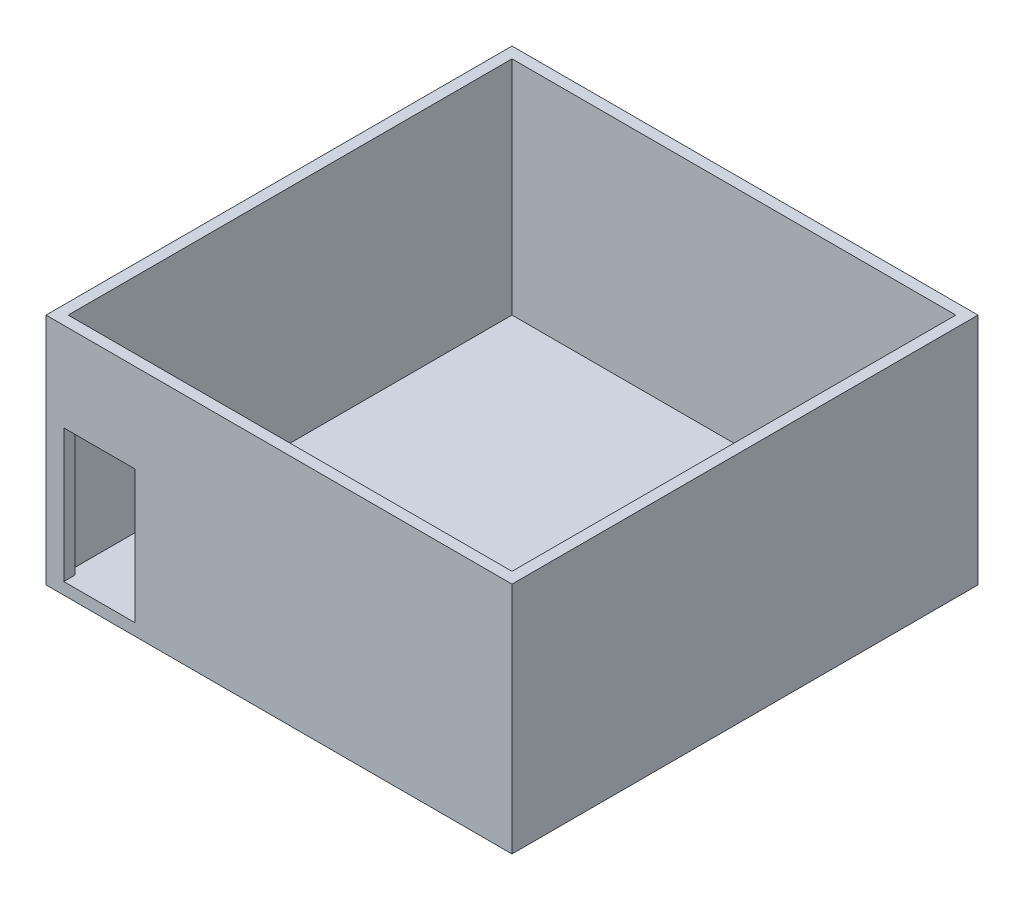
ISO-10303-21;
HEADER;
FILE_DESCRIPTION(('STEP AP214'),'2;1');
FILE_NAME('part.step','',(''),(''),'','','');
FILE_SCHEMA(('AUTOMOTIVE_DESIGN { 1 0 10303 214 1 1 1 1 }'));
ENDSEC;
DATA;
#1=APPLICATION_CONTEXT('core data for automotive mechanical design processes');
#2=APPLICATION_PROTOCOL_DEFINITION('international standard','automotive_design',2000,#1);
#3=PRODUCT_CONTEXT('',#1,'mechanical');
#4=PRODUCT('Part','Part','',(#3));
#5=PRODUCT_RELATED_PRODUCT_CATEGORY('part','',(#4));
#6=PRODUCT_DEFINITION_FORMATION('','',#4);
#7=PRODUCT_DEFINITION_CONTEXT('part definition',#1,'design');
#8=PRODUCT_DEFINITION('design','',#6,#7);
#9=PRODUCT_DEFINITION_SHAPE('','',#8);
#10=(LENGTH_UNIT() NAMED_UNIT(*) SI_UNIT(.MILLI.,.METRE.));
#11=(NAMED_UNIT(*) PLANE_ANGLE_UNIT() SI_UNIT($,.RADIAN.));
#12=(NAMED_UNIT(*) SI_UNIT($,.STERADIAN.) SOLID_ANGLE_UNIT());
#13=UNCERTAINTY_MEASURE_WITH_UNIT(LENGTH_MEASURE(1.E-05),#10,'distance_accuracy_value','');
#14=(GEOMETRIC_REPRESENTATION_CONTEXT(3) GLOBAL_UNCERTAINTY_ASSIGNED_CONTEXT((#13)) GLOBAL_UNIT_ASSIGNED_CONTEXT((#10,
#11,#12)) REPRESENTATION_CONTEXT('',''));
#15=CARTESIAN_POINT('',(0.,0.,0.));
#16=DIRECTION('',(0.,0.,1.));
#17=DIRECTION('',(1.,0.,0.));
#18=AXIS2_PLACEMENT_3D('',#15,#16,#17);
#19=CARTESIAN_POINT('',(250.,5000.,250.));
#20=DIRECTION('',(0.,1.,0.));
#21=DIRECTION('',(0.,0.,1.));
#22=AXIS2_PLACEMENT_3D('',#19,#20,#21);
#23=PLANE('',#22);
#24=DIRECTION('',(1.,0.,0.));
#25=VECTOR('',#24,1.);
#26=CARTESIAN_POINT('',(-10250.,5000.,250.));
#27=LINE('',#26,#25);
#28=CARTESIAN_POINT('',(-10250.,5000.,250.));
#29=VERTEX_POINT('',#28);
#30=CARTESIAN_POINT('',(250.,5000.,250.));
#31=VERTEX_POINT('',#30);
#32=EDGE_CURVE('E193',#29,#31,#27,.T.);
#33=ORIENTED_EDGE('',*,*,#32,.T.);
#34=DIRECTION('',(0.,0.,-1.));
#35=VECTOR('',#34,1.);
#36=CARTESIAN_POINT('',(250.,5000.,250.));
#37=LINE('',#36,#35);
#38=CARTESIAN_POINT('',(250.,5000.,-10250.));
#39=VERTEX_POINT('',#38);
#40=EDGE_CURVE('E196',#31,#39,#37,.T.);
#41=ORIENTED_EDGE('',*,*,#40,.T.);
#42=DIRECTION('',(-1.,0.,0.));
#43=VECTOR('',#42,1.);
#44=CARTESIAN_POINT('',(250.,5000.,-10250.));
#45=LINE('',#44,#43);
#46=CARTESIAN_POINT('',(-10250.,5000.,-10250.));
#47=VERTEX_POINT('',#46);
#48=EDGE_CURVE('E198',#39,#47,#45,.T.);
#49=ORIENTED_EDGE('',*,*,#48,.T.);
#50=DIRECTION('',(0.,0.,1.));
#51=VECTOR('',#50,1.);
#52=CARTESIAN_POINT('',(-10250.,5000.,-10250.));
#53=LINE('',#52,#51);
#54=EDGE_CURVE('E200',#47,#29,#53,.T.);
#55=ORIENTED_EDGE('',*,*,#54,.T.);
#56=EDGE_LOOP('',(#33,#41,#49,#55));
#57=FACE_BOUND('',#56,.T.);
#58=DIRECTION('',(0.,0.,-1.));
#59=VECTOR('',#58,1.);
#60=CARTESIAN_POINT('',(0.,5000.,0.));
#61=LINE('',#60,#59);
#62=CARTESIAN_POINT('',(0.,5000.,0.));
#63=VERTEX_POINT('',#62);
#64=CARTESIAN_POINT('',(0.,5000.,-10000.));
#65=VERTEX_POINT('',#64);
#66=EDGE_CURVE('E178',#63,#65,#61,.T.);
#67=ORIENTED_EDGE('',*,*,#66,.F.);
#68=DIRECTION('',(1.,0.,0.));
#69=VECTOR('',#68,1.);
#70=CARTESIAN_POINT('',(-10000.,5000.,0.));
#71=LINE('',#70,#69);
#72=CARTESIAN_POINT('',(-10000.,5000.,0.));
#73=VERTEX_POINT('',#72);
#74=EDGE_CURVE('E176',#73,#63,#71,.T.);
#75=ORIENTED_EDGE('',*,*,#74,.F.);
#76=DIRECTION('',(0.,0.,1.));
#77=VECTOR('',#76,1.);
#78=CARTESIAN_POINT('',(-10000.,5000.,-10000.));
#79=LINE('',#78,#77);
#80=CARTESIAN_POINT('',(-10000.,5000.,-10000.));
#81=VERTEX_POINT('',#80);
#82=EDGE_CURVE('E183',#81,#73,#79,.T.);
#83=ORIENTED_EDGE('',*,*,#82,.F.);
#84=DIRECTION('',(-1.,0.,0.));
#85=VECTOR('',#84,1.);
#86=CARTESIAN_POINT('',(0.,5000.,-10000.));
#87=LINE('',#86,#85);
#88=EDGE_CURVE('E180',#65,#81,#87,.T.);
#89=ORIENTED_EDGE('',*,*,#88,.F.);
#90=EDGE_LOOP('',(#67,#75,#83,#89));
#91=FACE_BOUND('',#90,.T.);
#92=ADVANCED_FACE('F29',(#57,#91),#23,.T.);
#93=CARTESIAN_POINT('',(-10250.,5000.,250.));
#94=DIRECTION('',(0.,0.,-1.));
#95=DIRECTION('',(-1.,0.,0.));
#96=AXIS2_PLACEMENT_3D('',#93,#94,#95);
#97=PLANE('',#96);
#98=DIRECTION('',(0.,1.,0.));
#99=VECTOR('',#98,1.);
#100=CARTESIAN_POINT('',(-8250.,3000.,250.));
#101=LINE('',#100,#99);
#102=CARTESIAN_POINT('',(-8250.,0.,250.));
#103=VERTEX_POINT('',#102);
#104=CARTESIAN_POINT('',(-8250.,3000.,250.));
#105=VERTEX_POINT('',#104);
#106=EDGE_CURVE('E132',#103,#105,#101,.T.);
#107=ORIENTED_EDGE('',*,*,#106,.F.);
#108=DIRECTION('',(1.,0.,0.));
#109=VECTOR('',#108,1.);
#110=CARTESIAN_POINT('',(-8250.,0.,250.));
#111=LINE('',#110,#109);
#112=CARTESIAN_POINT('',(-9850.,0.,250.));
#113=VERTEX_POINT('',#112);
#114=EDGE_CURVE('E44',#113,#103,#111,.T.);
#115=ORIENTED_EDGE('',*,*,#114,.F.);
#116=DIRECTION('',(0.,-1.,0.));
#117=VECTOR('',#116,1.);
#118=CARTESIAN_POINT('',(-9850.,0.,250.));
#119=LINE('',#118,#117);
#120=CARTESIAN_POINT('',(-9850.,3000.,250.));
#121=VERTEX_POINT('',#120);
#122=EDGE_CURVE('E141',#121,#113,#119,.T.);
#123=ORIENTED_EDGE('',*,*,#122,.F.);
#124=DIRECTION('',(-1.,0.,0.));
#125=VECTOR('',#124,1.);
#126=CARTESIAN_POINT('',(-9850.,3000.,250.));
#127=LINE('',#126,#125);
#128=EDGE_CURVE('E145',#105,#121,#127,.T.);
#129=ORIENTED_EDGE('',*,*,#128,.F.);
#130=EDGE_LOOP('',(#107,#115,#123,#129));
#131=FACE_BOUND('',#130,.T.);
#132=DIRECTION('',(0.,-1.,0.));
#133=VECTOR('',#132,1.);
#134=CARTESIAN_POINT('',(-10250.,5000.,250.));
#135=LINE('',#134,#133);
#136=CARTESIAN_POINT('',(-10250.,-265.654648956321,250.));
#137=VERTEX_POINT('',#136);
#138=EDGE_CURVE('E202',#29,#137,#135,.T.);
#139=ORIENTED_EDGE('',*,*,#138,.T.);
#140=DIRECTION('',(1.,0.,0.));
#141=VECTOR('',#140,1.);
#142=CARTESIAN_POINT('',(-10250.,-265.654648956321,250.));
#143=LINE('',#142,#141);
#144=CARTESIAN_POINT('',(250.,-265.65464895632,250.));
#145=VERTEX_POINT('',#144);
#146=EDGE_CURVE('E144',#137,#145,#143,.T.);
#147=ORIENTED_EDGE('',*,*,#146,.T.);
#148=DIRECTION('',(0.,-1.,0.));
#149=VECTOR('',#148,1.);
#150=CARTESIAN_POINT('',(250.,5000.,250.));
#151=LINE('',#150,#149);
#152=EDGE_CURVE('E11',#31,#145,#151,.T.);
#153=ORIENTED_EDGE('',*,*,#152,.F.);
#154=ORIENTED_EDGE('',*,*,#32,.F.);
#155=EDGE_LOOP('',(#139,#147,#153,#154));
#156=FACE_BOUND('',#155,.T.);
#157=ADVANCED_FACE('F31',(#131,#156),#97,.F.);
#158=CARTESIAN_POINT('',(250.,5000.,250.));
#159=DIRECTION('',(-1.,0.,0.));
#160=DIRECTION('',(0.,0.,1.));
#161=AXIS2_PLACEMENT_3D('',#158,#159,#160);
#162=PLANE('',#161);
#163=ORIENTED_EDGE('',*,*,#152,.T.);
#164=DIRECTION('',(0.,0.,1.));
#165=VECTOR('',#164,1.);
#166=CARTESIAN_POINT('',(250.,-265.65464895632,-20753.3600525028));
#167=LINE('',#166,#165);
#168=CARTESIAN_POINT('',(250.,-265.65464895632,-10250.));
#169=VERTEX_POINT('',#168);
#170=EDGE_CURVE('E156',#169,#145,#167,.T.);
#171=ORIENTED_EDGE('',*,*,#170,.F.);
#172=DIRECTION('',(0.,-1.,0.));
#173=VECTOR('',#172,1.);
#174=CARTESIAN_POINT('',(250.,5000.,-10250.));
#175=LINE('',#174,#173);
#176=EDGE_CURVE('E37',#39,#169,#175,.T.);
#177=ORIENTED_EDGE('',*,*,#176,.F.);
#178=ORIENTED_EDGE('',*,*,#40,.F.);
#179=EDGE_LOOP('',(#163,#171,#177,#178));
#180=FACE_BOUND('',#179,.T.);
#181=ADVANCED_FACE('F214',(#180),#162,.F.);
#182=CARTESIAN_POINT('',(250.,5000.,-10250.));
#183=DIRECTION('',(0.,0.,1.));
#184=DIRECTION('',(1.,0.,0.));
#185=AXIS2_PLACEMENT_3D('',#182,#183,#184);
#186=PLANE('',#185);
#187=ORIENTED_EDGE('',*,*,#176,.T.);
#188=DIRECTION('',(-1.,0.,0.));
#189=VECTOR('',#188,1.);
#190=CARTESIAN_POINT('',(-10250.,-265.654648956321,-10250.));
#191=LINE('',#190,#189);
#192=CARTESIAN_POINT('',(-10250.,-265.654648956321,-10250.));
#193=VERTEX_POINT('',#192);
#194=EDGE_CURVE('E159',#169,#193,#191,.T.);
#195=ORIENTED_EDGE('',*,*,#194,.T.);
#196=DIRECTION('',(0.,-1.,0.));
#197=VECTOR('',#196,1.);
#198=CARTESIAN_POINT('',(-10250.,5000.,-10250.));
#199=LINE('',#198,#197);
#200=EDGE_CURVE('E204',#47,#193,#199,.T.);
#201=ORIENTED_EDGE('',*,*,#200,.F.);
#202=ORIENTED_EDGE('',*,*,#48,.F.);
#203=EDGE_LOOP('',(#187,#195,#201,#202));
#204=FACE_BOUND('',#203,.T.);
#205=ADVANCED_FACE('F209',(#204),#186,.F.);
#206=CARTESIAN_POINT('',(-10250.,5000.,-10250.));
#207=DIRECTION('',(1.,0.,0.));
#208=DIRECTION('',(0.,0.,-1.));
#209=AXIS2_PLACEMENT_3D('',#206,#207,#208);
#210=PLANE('',#209);
#211=ORIENTED_EDGE('',*,*,#200,.T.);
#212=DIRECTION('',(0.,0.,1.));
#213=VECTOR('',#212,1.);
#214=CARTESIAN_POINT('',(-10250.,-265.654648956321,-20753.3600525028));
#215=LINE('',#214,#213);
#216=EDGE_CURVE('E155',#193,#137,#215,.T.);
#217=ORIENTED_EDGE('',*,*,#216,.T.);
#218=ORIENTED_EDGE('',*,*,#138,.F.);
#219=ORIENTED_EDGE('',*,*,#54,.F.);
#220=EDGE_LOOP('',(#211,#217,#218,#219));
#221=FACE_BOUND('',#220,.T.);
#222=ADVANCED_FACE('F221',(#221),#210,.F.);
#223=CARTESIAN_POINT('',(-10000.,5000.,0.));
#224=DIRECTION('',(0.,0.,-1.));
#225=DIRECTION('',(-1.,0.,0.));
#226=AXIS2_PLACEMENT_3D('',#223,#224,#225);
#227=PLANE('',#226);
#228=DIRECTION('',(0.,-1.,0.));
#229=VECTOR('',#228,1.);
#230=CARTESIAN_POINT('',(-9850.,0.,0.));
#231=LINE('',#230,#229);
#232=CARTESIAN_POINT('',(-9850.,3000.,0.));
#233=VERTEX_POINT('',#232);
#234=CARTESIAN_POINT('',(-9850.,0.,0.));
#235=VERTEX_POINT('',#234);
#236=EDGE_CURVE('E149',#233,#235,#231,.T.);
#237=ORIENTED_EDGE('',*,*,#236,.T.);
#238=DIRECTION('',(1.,0.,0.));
#239=VECTOR('',#238,1.);
#240=CARTESIAN_POINT('',(-10000.,0.,0.));
#241=LINE('',#240,#239);
#242=CARTESIAN_POINT('',(-10000.,0.,0.));
#243=VERTEX_POINT('',#242);
#244=EDGE_CURVE('E164',#243,#235,#241,.T.);
#245=ORIENTED_EDGE('',*,*,#244,.F.);
#246=DIRECTION('',(0.,-1.,0.));
#247=VECTOR('',#246,1.);
#248=CARTESIAN_POINT('',(-10000.,5000.,0.));
#249=LINE('',#248,#247);
#250=EDGE_CURVE('E185',#73,#243,#249,.T.);
#251=ORIENTED_EDGE('',*,*,#250,.F.);
#252=ORIENTED_EDGE('',*,*,#74,.T.);
#253=DIRECTION('',(0.,-1.,0.));
#254=VECTOR('',#253,1.);
#255=CARTESIAN_POINT('',(0.,5000.,0.));
#256=LINE('',#255,#254);
#257=CARTESIAN_POINT('',(0.,0.,0.));
#258=VERTEX_POINT('',#257);
#259=EDGE_CURVE('E191',#63,#258,#256,.T.);
#260=ORIENTED_EDGE('',*,*,#259,.T.);
#261=CARTESIAN_POINT('',(-8250.,0.,0.));
#262=VERTEX_POINT('',#261);
#263=EDGE_CURVE('E137',#262,#258,#241,.T.);
#264=ORIENTED_EDGE('',*,*,#263,.F.);
#265=DIRECTION('',(0.,1.,0.));
#266=VECTOR('',#265,1.);
#267=CARTESIAN_POINT('',(-8250.,3000.,0.));
#268=LINE('',#267,#266);
#269=CARTESIAN_POINT('',(-8250.,3000.,0.));
#270=VERTEX_POINT('',#269);
#271=EDGE_CURVE('E129',#262,#270,#268,.T.);
#272=ORIENTED_EDGE('',*,*,#271,.T.);
#273=DIRECTION('',(-1.,0.,0.));
#274=VECTOR('',#273,1.);
#275=CARTESIAN_POINT('',(-9850.,3000.,0.));
#276=LINE('',#275,#274);
#277=EDGE_CURVE('E115',#270,#233,#276,.T.);
#278=ORIENTED_EDGE('',*,*,#277,.T.);
#279=EDGE_LOOP('',(#237,#245,#251,#252,#260,#264,#272,#278));
#280=FACE_BOUND('',#279,.T.);
#281=ADVANCED_FACE('F135',(#280),#227,.T.);
#282=CARTESIAN_POINT('',(0.,5000.,0.));
#283=DIRECTION('',(-1.,0.,0.));
#284=DIRECTION('',(0.,0.,1.));
#285=AXIS2_PLACEMENT_3D('',#282,#283,#284);
#286=PLANE('',#285);
#287=DIRECTION('',(0.,0.,-1.));
#288=VECTOR('',#287,1.);
#289=CARTESIAN_POINT('',(0.,0.,0.));
#290=LINE('',#289,#288);
#291=CARTESIAN_POINT('',(0.,0.,-10000.));
#292=VERTEX_POINT('',#291);
#293=EDGE_CURVE('E167',#258,#292,#290,.T.);
#294=ORIENTED_EDGE('',*,*,#293,.F.);
#295=ORIENTED_EDGE('',*,*,#259,.F.);
#296=ORIENTED_EDGE('',*,*,#66,.T.);
#297=DIRECTION('',(0.,-1.,0.));
#298=VECTOR('',#297,1.);
#299=CARTESIAN_POINT('',(0.,5000.,-10000.));
#300=LINE('',#299,#298);
#301=EDGE_CURVE('E189',#65,#292,#300,.T.);
#302=ORIENTED_EDGE('',*,*,#301,.T.);
#303=EDGE_LOOP('',(#294,#295,#296,#302));
#304=FACE_BOUND('',#303,.T.);
#305=ADVANCED_FACE('F254',(#304),#286,.T.);
#306=CARTESIAN_POINT('',(0.,5000.,-10000.));
#307=DIRECTION('',(0.,0.,1.));
#308=DIRECTION('',(1.,0.,0.));
#309=AXIS2_PLACEMENT_3D('',#306,#307,#308);
#310=PLANE('',#309);
#311=DIRECTION('',(-1.,0.,0.));
#312=VECTOR('',#311,1.);
#313=CARTESIAN_POINT('',(0.,0.,-10000.));
#314=LINE('',#313,#312);
#315=CARTESIAN_POINT('',(-10000.,0.,-10000.));
#316=VERTEX_POINT('',#315);
#317=EDGE_CURVE('E170',#292,#316,#314,.T.);
#318=ORIENTED_EDGE('',*,*,#317,.F.);
#319=ORIENTED_EDGE('',*,*,#301,.F.);
#320=ORIENTED_EDGE('',*,*,#88,.T.);
#321=DIRECTION('',(0.,-1.,0.));
#322=VECTOR('',#321,1.);
#323=CARTESIAN_POINT('',(-10000.,5000.,-10000.));
#324=LINE('',#323,#322);
#325=EDGE_CURVE('E187',#81,#316,#324,.T.);
#326=ORIENTED_EDGE('',*,*,#325,.T.);
#327=EDGE_LOOP('',(#318,#319,#320,#326));
#328=FACE_BOUND('',#327,.T.);
#329=ADVANCED_FACE('F256',(#328),#310,.T.);
#330=CARTESIAN_POINT('',(-10000.,5000.,-10000.));
#331=DIRECTION('',(1.,0.,0.));
#332=DIRECTION('',(0.,0.,-1.));
#333=AXIS2_PLACEMENT_3D('',#330,#331,#332);
#334=PLANE('',#333);
#335=DIRECTION('',(0.,0.,1.));
#336=VECTOR('',#335,1.);
#337=CARTESIAN_POINT('',(-10000.,0.,-10000.));
#338=LINE('',#337,#336);
#339=EDGE_CURVE('E173',#316,#243,#338,.T.);
#340=ORIENTED_EDGE('',*,*,#339,.F.);
#341=ORIENTED_EDGE('',*,*,#325,.F.);
#342=ORIENTED_EDGE('',*,*,#82,.T.);
#343=ORIENTED_EDGE('',*,*,#250,.T.);
#344=EDGE_LOOP('',(#340,#341,#342,#343));
#345=FACE_BOUND('',#344,.T.);
#346=ADVANCED_FACE('F245',(#345),#334,.T.);
#347=CARTESIAN_POINT('',(-10250.,0.,-20753.3600525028));
#348=DIRECTION('',(0.,1.,0.));
#349=DIRECTION('',(0.,0.,1.));
#350=AXIS2_PLACEMENT_3D('',#347,#348,#349);
#351=PLANE('',#350);
#352=ORIENTED_EDGE('',*,*,#339,.T.);
#353=ORIENTED_EDGE('',*,*,#244,.T.);
#354=DIRECTION('',(0.,0.,1.));
#355=VECTOR('',#354,1.);
#356=CARTESIAN_POINT('',(-9850.,0.,-10250.001));
#357=LINE('',#356,#355);
#358=EDGE_CURVE('E125',#235,#113,#357,.T.);
#359=ORIENTED_EDGE('',*,*,#358,.T.);
#360=ORIENTED_EDGE('',*,*,#114,.T.);
#361=DIRECTION('',(0.,0.,1.));
#362=VECTOR('',#361,1.);
#363=CARTESIAN_POINT('',(-8250.,0.,-10250.001));
#364=LINE('',#363,#362);
#365=EDGE_CURVE('E48',#262,#103,#364,.T.);
#366=ORIENTED_EDGE('',*,*,#365,.F.);
#367=ORIENTED_EDGE('',*,*,#263,.T.);
#368=ORIENTED_EDGE('',*,*,#293,.T.);
#369=ORIENTED_EDGE('',*,*,#317,.T.);
#370=EDGE_LOOP('',(#352,#353,#359,#360,#366,#367,#368,#369));
#371=FACE_BOUND('',#370,.T.);
#372=ADVANCED_FACE('F241',(#371),#351,.T.);
#373=CARTESIAN_POINT('',(-10250.,-265.654648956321,-20753.3600525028));
#374=DIRECTION('',(0.,-1.,0.));
#375=DIRECTION('',(1.,0.,0.));
#376=AXIS2_PLACEMENT_3D('',#373,#374,#375);
#377=PLANE('',#376);
#378=ORIENTED_EDGE('',*,*,#194,.F.);
#379=ORIENTED_EDGE('',*,*,#170,.T.);
#380=ORIENTED_EDGE('',*,*,#146,.F.);
#381=ORIENTED_EDGE('',*,*,#216,.F.);
#382=EDGE_LOOP('',(#378,#379,#380,#381));
#383=FACE_BOUND('',#382,.T.);
#384=ADVANCED_FACE('F218',(#383),#377,.T.);
#385=CARTESIAN_POINT('',(-9850.,0.,-10250.001));
#386=DIRECTION('',(-1.,0.,0.));
#387=DIRECTION('',(0.,0.,1.));
#388=AXIS2_PLACEMENT_3D('',#385,#386,#387);
#389=PLANE('',#388);
#390=DIRECTION('',(0.,0.,1.));
#391=VECTOR('',#390,1.);
#392=CARTESIAN_POINT('',(-9850.,3000.,-10250.001));
#393=LINE('',#392,#391);
#394=EDGE_CURVE('E121',#233,#121,#393,.T.);
#395=ORIENTED_EDGE('',*,*,#394,.T.);
#396=ORIENTED_EDGE('',*,*,#122,.T.);
#397=ORIENTED_EDGE('',*,*,#358,.F.);
#398=ORIENTED_EDGE('',*,*,#236,.F.);
#399=EDGE_LOOP('',(#395,#396,#397,#398));
#400=FACE_BOUND('',#399,.T.);
#401=ADVANCED_FACE('F238',(#400),#389,.F.);
#402=CARTESIAN_POINT('',(-9850.,3000.,-10250.001));
#403=DIRECTION('',(0.,1.,0.));
#404=DIRECTION('',(0.,0.,1.));
#405=AXIS2_PLACEMENT_3D('',#402,#403,#404);
#406=PLANE('',#405);
#407=DIRECTION('',(0.,0.,1.));
#408=VECTOR('',#407,1.);
#409=CARTESIAN_POINT('',(-8250.,3000.,-10250.001));
#410=LINE('',#409,#408);
#411=EDGE_CURVE('E119',#270,#105,#410,.T.);
#412=ORIENTED_EDGE('',*,*,#411,.T.);
#413=ORIENTED_EDGE('',*,*,#128,.T.);
#414=ORIENTED_EDGE('',*,*,#394,.F.);
#415=ORIENTED_EDGE('',*,*,#277,.F.);
#416=EDGE_LOOP('',(#412,#413,#414,#415));
#417=FACE_BOUND('',#416,.T.);
#418=ADVANCED_FACE('F117',(#417),#406,.F.);
#419=CARTESIAN_POINT('',(-8250.,3000.,-10250.001));
#420=DIRECTION('',(1.,0.,0.));
#421=DIRECTION('',(0.,0.,-1.));
#422=AXIS2_PLACEMENT_3D('',#419,#420,#421);
#423=PLANE('',#422);
#424=ORIENTED_EDGE('',*,*,#365,.T.);
#425=ORIENTED_EDGE('',*,*,#106,.T.);
#426=ORIENTED_EDGE('',*,*,#411,.F.);
#427=ORIENTED_EDGE('',*,*,#271,.F.);
#428=EDGE_LOOP('',(#424,#425,#426,#427));
#429=FACE_BOUND('',#428,.T.);
#430=ADVANCED_FACE('F128',(#429),#423,.F.);
#431=CLOSED_SHELL('',(#92,#157,#181,#205,#222,#281,#305,#329,#346,#372,#384,#401,#418,#430));
#432=MANIFOLD_SOLID_BREP('B2',#431);
#433=ADVANCED_BREP_SHAPE_REPRESENTATION('',(#18,#432),#14);
#434=SHAPE_DEFINITION_REPRESENTATION(#9,#433);
ENDSEC;
END-ISO-10303-21;
